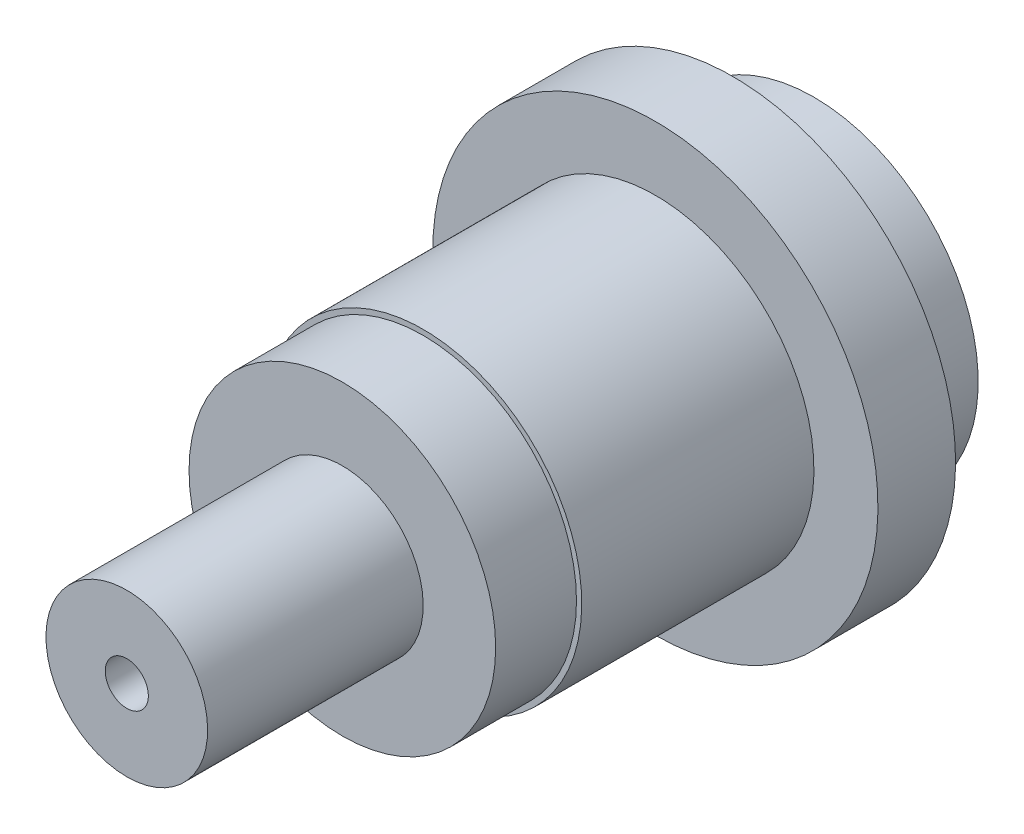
ISO-10303-21;
HEADER;
FILE_DESCRIPTION(('STEP AP214'),'2;1');
FILE_NAME('part.step','',(''),(''),'','','');
FILE_SCHEMA(('AUTOMOTIVE_DESIGN { 1 0 10303 214 1 1 1 1 }'));
ENDSEC;
DATA;
#1=APPLICATION_CONTEXT('core data for automotive mechanical design processes');
#2=APPLICATION_PROTOCOL_DEFINITION('international standard','automotive_design',2000,#1);
#3=PRODUCT_CONTEXT('',#1,'mechanical');
#4=PRODUCT('Part','Part','',(#3));
#5=PRODUCT_RELATED_PRODUCT_CATEGORY('part','',(#4));
#6=PRODUCT_DEFINITION_FORMATION('','',#4);
#7=PRODUCT_DEFINITION_CONTEXT('part definition',#1,'design');
#8=PRODUCT_DEFINITION('design','',#6,#7);
#9=PRODUCT_DEFINITION_SHAPE('','',#8);
#10=(LENGTH_UNIT() NAMED_UNIT(*) SI_UNIT(.MILLI.,.METRE.));
#11=(NAMED_UNIT(*) PLANE_ANGLE_UNIT() SI_UNIT($,.RADIAN.));
#12=(NAMED_UNIT(*) SI_UNIT($,.STERADIAN.) SOLID_ANGLE_UNIT());
#13=UNCERTAINTY_MEASURE_WITH_UNIT(LENGTH_MEASURE(1.E-05),#10,'distance_accuracy_value','');
#14=(GEOMETRIC_REPRESENTATION_CONTEXT(3) GLOBAL_UNCERTAINTY_ASSIGNED_CONTEXT((#13)) GLOBAL_UNIT_ASSIGNED_CONTEXT((#10,
#11,#12)) REPRESENTATION_CONTEXT('',''));
#15=CARTESIAN_POINT('',(0.,0.,0.));
#16=DIRECTION('',(0.,0.,1.));
#17=DIRECTION('',(1.,0.,0.));
#18=AXIS2_PLACEMENT_3D('',#15,#16,#17);
#19=CARTESIAN_POINT('',(0.,0.,10.8184059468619));
#20=DIRECTION('',(0.,0.,-1.));
#21=DIRECTION('',(0.,-1.,0.));
#22=AXIS2_PLACEMENT_3D('',#19,#20,#21);
#23=PLANE('',#22);
#24=CARTESIAN_POINT('',(0.,0.,10.8184059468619));
#25=DIRECTION('',(0.,0.,1.));
#26=DIRECTION('',(0.,-1.,0.));
#27=AXIS2_PLACEMENT_3D('',#24,#25,#26);
#28=CIRCLE('',#27,0.8);
#29=CARTESIAN_POINT('',(0.,-0.8,10.8184059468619));
#30=VERTEX_POINT('',#29);
#31=EDGE_CURVE('E107',#30,#30,#28,.T.);
#32=ORIENTED_EDGE('',*,*,#31,.T.);
#33=EDGE_LOOP('',(#32));
#34=FACE_BOUND('',#33,.T.);
#35=ADVANCED_FACE('F16',(#34),#23,.F.);
#36=CARTESIAN_POINT('',(0.,0.,19.6184059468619));
#37=DIRECTION('',(0.,0.,-1.));
#38=DIRECTION('',(0.,-1.,0.));
#39=AXIS2_PLACEMENT_3D('',#36,#37,#38);
#40=CYLINDRICAL_SURFACE('',#39,8.26);
#41=CARTESIAN_POINT('',(0.,0.,0.));
#42=DIRECTION('',(0.,0.,1.));
#43=DIRECTION('',(0.,-1.,0.));
#44=AXIS2_PLACEMENT_3D('',#41,#42,#43);
#45=CIRCLE('',#44,8.26);
#46=CARTESIAN_POINT('',(0.,-8.26,0.));
#47=VERTEX_POINT('',#46);
#48=EDGE_CURVE('E88',#47,#47,#45,.T.);
#49=ORIENTED_EDGE('',*,*,#48,.F.);
#50=EDGE_LOOP('',(#49));
#51=FACE_BOUND('',#50,.T.);
#52=CARTESIAN_POINT('',(0.,0.,-2.88));
#53=DIRECTION('',(0.,0.,1.));
#54=DIRECTION('',(0.,-1.,0.));
#55=AXIS2_PLACEMENT_3D('',#52,#53,#54);
#56=CIRCLE('',#55,8.26);
#57=CARTESIAN_POINT('',(0.,-8.26,-2.88));
#58=VERTEX_POINT('',#57);
#59=EDGE_CURVE('E11',#58,#58,#56,.T.);
#60=ORIENTED_EDGE('',*,*,#59,.T.);
#61=EDGE_LOOP('',(#60));
#62=FACE_BOUND('',#61,.T.);
#63=ADVANCED_FACE('F18',(#51,#62),#40,.T.);
#64=CARTESIAN_POINT('',(0.,6.1,-2.88));
#65=DIRECTION('',(0.,0.,1.));
#66=DIRECTION('',(0.,-1.,0.));
#67=AXIS2_PLACEMENT_3D('',#64,#65,#66);
#68=PLANE('',#67);
#69=CARTESIAN_POINT('',(0.,0.,-2.88));
#70=DIRECTION('',(0.,0.,1.));
#71=DIRECTION('',(0.,-1.,0.));
#72=AXIS2_PLACEMENT_3D('',#69,#70,#71);
#73=CIRCLE('',#72,6.1);
#74=CARTESIAN_POINT('',(0.,-6.1,-2.88));
#75=VERTEX_POINT('',#74);
#76=EDGE_CURVE('E94',#75,#75,#73,.T.);
#77=ORIENTED_EDGE('',*,*,#76,.T.);
#78=EDGE_LOOP('',(#77));
#79=FACE_BOUND('',#78,.T.);
#80=ORIENTED_EDGE('',*,*,#59,.F.);
#81=EDGE_LOOP('',(#80));
#82=FACE_BOUND('',#81,.T.);
#83=ADVANCED_FACE('F125',(#79,#82),#68,.F.);
#84=CARTESIAN_POINT('',(0.,5.885,8.6184059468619));
#85=DIRECTION('',(0.,0.,-1.));
#86=DIRECTION('',(0.,-1.,0.));
#87=AXIS2_PLACEMENT_3D('',#84,#85,#86);
#88=PLANE('',#87);
#89=CARTESIAN_POINT('',(0.,0.,8.6184059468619));
#90=DIRECTION('',(0.,0.,1.));
#91=DIRECTION('',(0.,-1.,0.));
#92=AXIS2_PLACEMENT_3D('',#89,#90,#91);
#93=CIRCLE('',#92,5.69);
#94=CARTESIAN_POINT('',(0.,-5.69,8.6184059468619));
#95=VERTEX_POINT('',#94);
#96=EDGE_CURVE('E27',#95,#95,#93,.T.);
#97=ORIENTED_EDGE('',*,*,#96,.F.);
#98=EDGE_LOOP('',(#97));
#99=FACE_BOUND('',#98,.T.);
#100=CARTESIAN_POINT('',(0.,0.,8.6184059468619));
#101=DIRECTION('',(0.,0.,1.));
#102=DIRECTION('',(0.,-1.,0.));
#103=AXIS2_PLACEMENT_3D('',#100,#101,#102);
#104=CIRCLE('',#103,5.885);
#105=CARTESIAN_POINT('',(0.,-5.885,8.6184059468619));
#106=VERTEX_POINT('',#105);
#107=EDGE_CURVE('E117',#106,#106,#104,.T.);
#108=ORIENTED_EDGE('',*,*,#107,.T.);
#109=EDGE_LOOP('',(#108));
#110=FACE_BOUND('',#109,.T.);
#111=ADVANCED_FACE('F157',(#99,#110),#88,.F.);
#112=CARTESIAN_POINT('',(0.,0.,19.6184059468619));
#113=DIRECTION('',(0.,0.,-1.));
#114=DIRECTION('',(0.,-1.,0.));
#115=AXIS2_PLACEMENT_3D('',#112,#113,#114);
#116=CYLINDRICAL_SURFACE('',#115,5.69);
#117=CARTESIAN_POINT('',(0.,0.,11.6184059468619));
#118=DIRECTION('',(0.,0.,1.));
#119=DIRECTION('',(0.,-1.,0.));
#120=AXIS2_PLACEMENT_3D('',#117,#118,#119);
#121=CIRCLE('',#120,5.69);
#122=CARTESIAN_POINT('',(0.,-5.69,11.6184059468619));
#123=VERTEX_POINT('',#122);
#124=EDGE_CURVE('E95',#123,#123,#121,.T.);
#125=ORIENTED_EDGE('',*,*,#124,.F.);
#126=EDGE_LOOP('',(#125));
#127=FACE_BOUND('',#126,.T.);
#128=ORIENTED_EDGE('',*,*,#96,.T.);
#129=EDGE_LOOP('',(#128));
#130=FACE_BOUND('',#129,.T.);
#131=ADVANCED_FACE('F154',(#127,#130),#116,.T.);
#132=CARTESIAN_POINT('',(0.,5.69,11.6184059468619));
#133=DIRECTION('',(0.,0.,-1.));
#134=DIRECTION('',(0.,-1.,0.));
#135=AXIS2_PLACEMENT_3D('',#132,#133,#134);
#136=PLANE('',#135);
#137=CARTESIAN_POINT('',(0.,0.,11.6184059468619));
#138=DIRECTION('',(0.,0.,1.));
#139=DIRECTION('',(0.,-1.,0.));
#140=AXIS2_PLACEMENT_3D('',#137,#138,#139);
#141=CIRCLE('',#140,3.);
#142=CARTESIAN_POINT('',(0.,-3.,11.6184059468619));
#143=VERTEX_POINT('',#142);
#144=EDGE_CURVE('E20',#143,#143,#141,.T.);
#145=ORIENTED_EDGE('',*,*,#144,.F.);
#146=EDGE_LOOP('',(#145));
#147=FACE_BOUND('',#146,.T.);
#148=ORIENTED_EDGE('',*,*,#124,.T.);
#149=EDGE_LOOP('',(#148));
#150=FACE_BOUND('',#149,.T.);
#151=ADVANCED_FACE('F156',(#147,#150),#136,.F.);
#152=CARTESIAN_POINT('',(0.,0.,19.6184059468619));
#153=DIRECTION('',(0.,0.,-1.));
#154=DIRECTION('',(0.,-1.,0.));
#155=AXIS2_PLACEMENT_3D('',#152,#153,#154);
#156=CYLINDRICAL_SURFACE('',#155,3.);
#157=CARTESIAN_POINT('',(0.,0.,19.6184059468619));
#158=DIRECTION('',(0.,0.,1.));
#159=DIRECTION('',(0.,-1.,0.));
#160=AXIS2_PLACEMENT_3D('',#157,#158,#159);
#161=CIRCLE('',#160,3.);
#162=CARTESIAN_POINT('',(0.,-3.,19.6184059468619));
#163=VERTEX_POINT('',#162);
#164=EDGE_CURVE('E91',#163,#163,#161,.T.);
#165=ORIENTED_EDGE('',*,*,#164,.F.);
#166=EDGE_LOOP('',(#165));
#167=FACE_BOUND('',#166,.T.);
#168=ORIENTED_EDGE('',*,*,#144,.T.);
#169=EDGE_LOOP('',(#168));
#170=FACE_BOUND('',#169,.T.);
#171=ADVANCED_FACE('F140',(#167,#170),#156,.T.);
#172=CARTESIAN_POINT('',(0.,3.,19.6184059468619));
#173=DIRECTION('',(0.,0.,-1.));
#174=DIRECTION('',(0.,-1.,0.));
#175=AXIS2_PLACEMENT_3D('',#172,#173,#174);
#176=PLANE('',#175);
#177=CARTESIAN_POINT('',(0.,0.,19.6184059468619));
#178=DIRECTION('',(0.,0.,-1.));
#179=DIRECTION('',(0.,-1.,0.));
#180=AXIS2_PLACEMENT_3D('',#177,#178,#179);
#181=CIRCLE('',#180,0.8);
#182=CARTESIAN_POINT('',(0.,-0.8,19.6184059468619));
#183=VERTEX_POINT('',#182);
#184=EDGE_CURVE('E102',#183,#183,#181,.T.);
#185=ORIENTED_EDGE('',*,*,#184,.T.);
#186=EDGE_LOOP('',(#185));
#187=FACE_BOUND('',#186,.T.);
#188=ORIENTED_EDGE('',*,*,#164,.T.);
#189=EDGE_LOOP('',(#188));
#190=FACE_BOUND('',#189,.T.);
#191=ADVANCED_FACE('F130',(#187,#190),#176,.F.);
#192=CARTESIAN_POINT('',(0.,0.,19.6184059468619));
#193=DIRECTION('',(0.,0.,-1.));
#194=DIRECTION('',(0.,-1.,0.));
#195=AXIS2_PLACEMENT_3D('',#192,#193,#194);
#196=CYLINDRICAL_SURFACE('',#195,6.1);
#197=ORIENTED_EDGE('',*,*,#76,.F.);
#198=EDGE_LOOP('',(#197));
#199=FACE_BOUND('',#198,.T.);
#200=CARTESIAN_POINT('',(0.,0.,-5.88));
#201=DIRECTION('',(0.,0.,1.));
#202=DIRECTION('',(0.,-1.,0.));
#203=AXIS2_PLACEMENT_3D('',#200,#201,#202);
#204=CIRCLE('',#203,6.1);
#205=CARTESIAN_POINT('',(0.,-6.1,-5.88));
#206=VERTEX_POINT('',#205);
#207=EDGE_CURVE('E80',#206,#206,#204,.T.);
#208=ORIENTED_EDGE('',*,*,#207,.T.);
#209=EDGE_LOOP('',(#208));
#210=FACE_BOUND('',#209,.T.);
#211=ADVANCED_FACE('F81',(#199,#210),#196,.T.);
#212=CARTESIAN_POINT('',(0.,0.,19.6184059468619));
#213=DIRECTION('',(0.,0.,-1.));
#214=DIRECTION('',(0.,-1.,0.));
#215=AXIS2_PLACEMENT_3D('',#212,#213,#214);
#216=CYLINDRICAL_SURFACE('',#215,5.885);
#217=ORIENTED_EDGE('',*,*,#107,.F.);
#218=EDGE_LOOP('',(#217));
#219=FACE_BOUND('',#218,.T.);
#220=CARTESIAN_POINT('',(0.,0.,0.));
#221=DIRECTION('',(0.,0.,1.));
#222=DIRECTION('',(0.,-1.,0.));
#223=AXIS2_PLACEMENT_3D('',#220,#221,#222);
#224=CIRCLE('',#223,5.885);
#225=CARTESIAN_POINT('',(0.,-5.885,0.));
#226=VERTEX_POINT('',#225);
#227=EDGE_CURVE('E103',#226,#226,#224,.T.);
#228=ORIENTED_EDGE('',*,*,#227,.T.);
#229=EDGE_LOOP('',(#228));
#230=FACE_BOUND('',#229,.T.);
#231=ADVANCED_FACE('F129',(#219,#230),#216,.T.);
#232=CARTESIAN_POINT('',(0.,0.,19.6184059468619));
#233=DIRECTION('',(0.,0.,1.));
#234=DIRECTION('',(0.,-1.,0.));
#235=AXIS2_PLACEMENT_3D('',#232,#233,#234);
#236=CYLINDRICAL_SURFACE('',#235,0.8);
#237=ORIENTED_EDGE('',*,*,#31,.F.);
#238=EDGE_LOOP('',(#237));
#239=FACE_BOUND('',#238,.T.);
#240=ORIENTED_EDGE('',*,*,#184,.F.);
#241=EDGE_LOOP('',(#240));
#242=FACE_BOUND('',#241,.T.);
#243=ADVANCED_FACE('F137',(#239,#242),#236,.F.);
#244=CARTESIAN_POINT('',(0.,0.,3.12));
#245=DIRECTION('',(0.,0.,1.));
#246=DIRECTION('',(-1.,0.,0.));
#247=AXIS2_PLACEMENT_3D('',#244,#245,#246);
#248=SPHERICAL_SURFACE('',#247,4.);
#249=CARTESIAN_POINT('',(0.,0.,3.12));
#250=DIRECTION('',(0.,0.,1.));
#251=DIRECTION('',(1.,0.,0.));
#252=AXIS2_PLACEMENT_3D('',#249,#250,#251);
#253=CIRCLE('',#252,4.);
#254=CARTESIAN_POINT('',(4.,0.,3.12));
#255=VERTEX_POINT('',#254);
#256=EDGE_CURVE('E99',#255,#255,#253,.T.);
#257=ORIENTED_EDGE('',*,*,#256,.F.);
#258=EDGE_LOOP('',(#257));
#259=FACE_BOUND('',#258,.T.);
#260=ADVANCED_FACE('F213',(#259),#248,.F.);
#261=CARTESIAN_POINT('',(0.,0.,7.12));
#262=DIRECTION('',(0.,0.,-1.));
#263=DIRECTION('',(1.,0.,0.));
#264=AXIS2_PLACEMENT_3D('',#261,#262,#263);
#265=CYLINDRICAL_SURFACE('',#264,4.);
#266=ORIENTED_EDGE('',*,*,#256,.T.);
#267=EDGE_LOOP('',(#266));
#268=FACE_BOUND('',#267,.T.);
#269=CARTESIAN_POINT('',(0.,0.,-5.88));
#270=DIRECTION('',(0.,0.,-1.));
#271=DIRECTION('',(0.,-1.,0.));
#272=AXIS2_PLACEMENT_3D('',#269,#270,#271);
#273=CIRCLE('',#272,4.);
#274=CARTESIAN_POINT('',(0.,-4.,-5.88));
#275=VERTEX_POINT('',#274);
#276=EDGE_CURVE('E84',#275,#275,#273,.T.);
#277=ORIENTED_EDGE('',*,*,#276,.T.);
#278=EDGE_LOOP('',(#277));
#279=FACE_BOUND('',#278,.T.);
#280=ADVANCED_FACE('F206',(#268,#279),#265,.F.);
#281=CARTESIAN_POINT('',(0.,8.26,0.));
#282=DIRECTION('',(0.,0.,-1.));
#283=DIRECTION('',(0.,-1.,0.));
#284=AXIS2_PLACEMENT_3D('',#281,#282,#283);
#285=PLANE('',#284);
#286=ORIENTED_EDGE('',*,*,#227,.F.);
#287=EDGE_LOOP('',(#286));
#288=FACE_BOUND('',#287,.T.);
#289=ORIENTED_EDGE('',*,*,#48,.T.);
#290=EDGE_LOOP('',(#289));
#291=FACE_BOUND('',#290,.T.);
#292=ADVANCED_FACE('F196',(#288,#291),#285,.F.);
#293=CARTESIAN_POINT('',(0.,0.,-5.88));
#294=DIRECTION('',(0.,0.,1.));
#295=DIRECTION('',(0.,-1.,0.));
#296=AXIS2_PLACEMENT_3D('',#293,#294,#295);
#297=PLANE('',#296);
#298=ORIENTED_EDGE('',*,*,#276,.F.);
#299=EDGE_LOOP('',(#298));
#300=FACE_BOUND('',#299,.T.);
#301=ORIENTED_EDGE('',*,*,#207,.F.);
#302=EDGE_LOOP('',(#301));
#303=FACE_BOUND('',#302,.T.);
#304=ADVANCED_FACE('F191',(#300,#303),#297,.F.);
#305=CLOSED_SHELL('',(#35,#63,#83,#111,#131,#151,#171,#191,#211,#231,#243,#260,#280,#292,#304));
#306=MANIFOLD_SOLID_BREP('B1',#305);
#307=ADVANCED_BREP_SHAPE_REPRESENTATION('',(#18,#306),#14);
#308=SHAPE_DEFINITION_REPRESENTATION(#9,#307);
ENDSEC;
END-ISO-10303-21;
